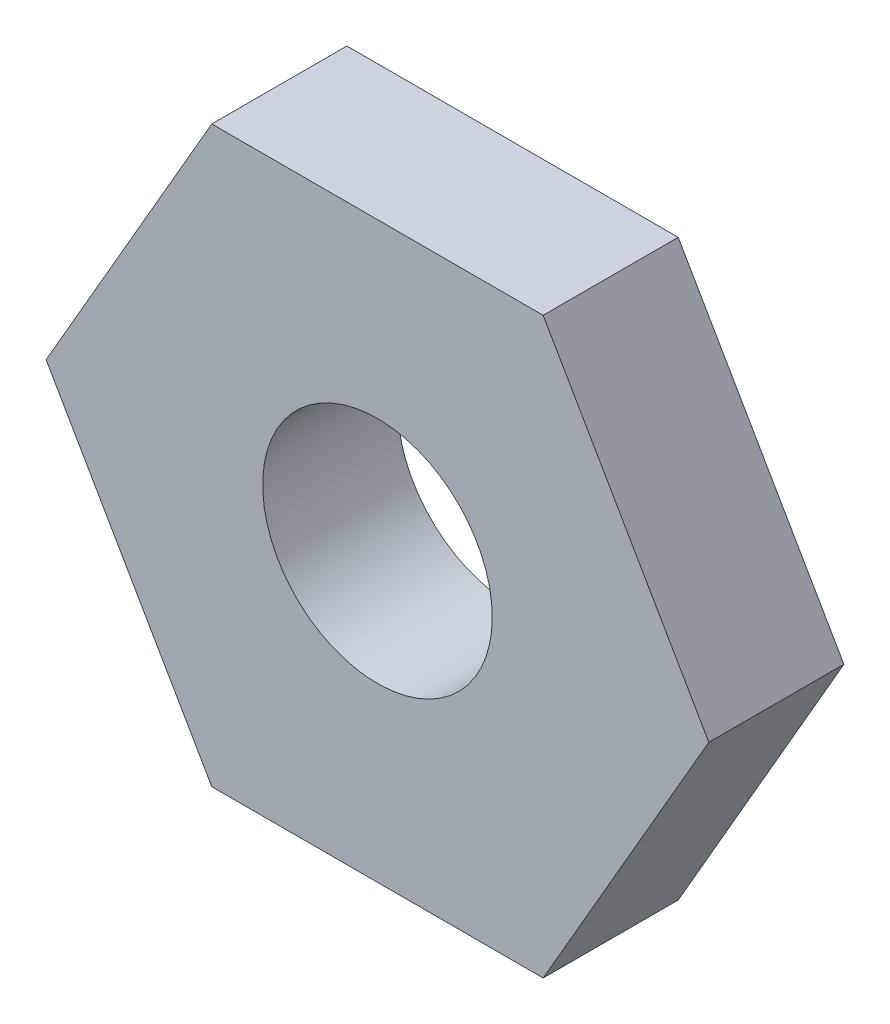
ISO-10303-21;
HEADER;
FILE_DESCRIPTION(('STEP AP214'),'2;1');
FILE_NAME('part.step','',(''),(''),'','','');
FILE_SCHEMA(('AUTOMOTIVE_DESIGN { 1 0 10303 214 1 1 1 1 }'));
ENDSEC;
DATA;
#1=APPLICATION_CONTEXT('core data for automotive mechanical design processes');
#2=APPLICATION_PROTOCOL_DEFINITION('international standard','automotive_design',2000,#1);
#3=PRODUCT_CONTEXT('',#1,'mechanical');
#4=PRODUCT('Part','Part','',(#3));
#5=PRODUCT_RELATED_PRODUCT_CATEGORY('part','',(#4));
#6=PRODUCT_DEFINITION_FORMATION('','',#4);
#7=PRODUCT_DEFINITION_CONTEXT('part definition',#1,'design');
#8=PRODUCT_DEFINITION('design','',#6,#7);
#9=PRODUCT_DEFINITION_SHAPE('','',#8);
#10=(LENGTH_UNIT() NAMED_UNIT(*) SI_UNIT(.MILLI.,.METRE.));
#11=(NAMED_UNIT(*) PLANE_ANGLE_UNIT() SI_UNIT($,.RADIAN.));
#12=(NAMED_UNIT(*) SI_UNIT($,.STERADIAN.) SOLID_ANGLE_UNIT());
#13=UNCERTAINTY_MEASURE_WITH_UNIT(LENGTH_MEASURE(1.E-05),#10,'distance_accuracy_value','');
#14=(GEOMETRIC_REPRESENTATION_CONTEXT(3) GLOBAL_UNCERTAINTY_ASSIGNED_CONTEXT((#13)) GLOBAL_UNIT_ASSIGNED_CONTEXT((#10,
#11,#12)) REPRESENTATION_CONTEXT('',''));
#15=CARTESIAN_POINT('',(0.,0.,0.));
#16=DIRECTION('',(0.,0.,1.));
#17=DIRECTION('',(1.,0.,0.));
#18=AXIS2_PLACEMENT_3D('',#15,#16,#17);
#19=CARTESIAN_POINT('',(-4.90747728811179,-8.5,4.));
#20=DIRECTION('',(0.866025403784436,0.500000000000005,0.));
#21=DIRECTION('',(-0.500000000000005,0.866025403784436,0.));
#22=AXIS2_PLACEMENT_3D('',#19,#20,#21);
#23=PLANE('',#22);
#24=DIRECTION('',(0.500000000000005,-0.866025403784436,0.));
#25=VECTOR('',#24,1.);
#26=CARTESIAN_POINT('',(-4.90747728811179,-8.5,0.));
#27=LINE('',#26,#25);
#28=CARTESIAN_POINT('',(-9.81495457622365,0.,0.));
#29=VERTEX_POINT('',#28);
#30=CARTESIAN_POINT('',(-4.90747728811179,-8.5,0.));
#31=VERTEX_POINT('',#30);
#32=EDGE_CURVE('E87',#29,#31,#27,.T.);
#33=ORIENTED_EDGE('',*,*,#32,.T.);
#34=DIRECTION('',(0.,0.,-1.));
#35=VECTOR('',#34,1.);
#36=CARTESIAN_POINT('',(-4.90747728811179,-8.5,4.));
#37=LINE('',#36,#35);
#38=CARTESIAN_POINT('',(-4.90747728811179,-8.5,4.));
#39=VERTEX_POINT('',#38);
#40=EDGE_CURVE('E11',#39,#31,#37,.T.);
#41=ORIENTED_EDGE('',*,*,#40,.F.);
#42=DIRECTION('',(0.500000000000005,-0.866025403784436,0.));
#43=VECTOR('',#42,1.);
#44=CARTESIAN_POINT('',(-4.90747728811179,-8.5,4.));
#45=LINE('',#44,#43);
#46=CARTESIAN_POINT('',(-9.81495457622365,0.,4.));
#47=VERTEX_POINT('',#46);
#48=EDGE_CURVE('E115',#47,#39,#45,.T.);
#49=ORIENTED_EDGE('',*,*,#48,.F.);
#50=DIRECTION('',(0.,0.,-1.));
#51=VECTOR('',#50,1.);
#52=CARTESIAN_POINT('',(-9.81495457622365,0.,4.));
#53=LINE('',#52,#51);
#54=EDGE_CURVE('E100',#47,#29,#53,.T.);
#55=ORIENTED_EDGE('',*,*,#54,.T.);
#56=EDGE_LOOP('',(#33,#41,#49,#55));
#57=FACE_BOUND('',#56,.T.);
#58=ADVANCED_FACE('F31',(#57),#23,.F.);
#59=CARTESIAN_POINT('',(4.90747728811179,-8.5,4.));
#60=DIRECTION('',(0.,1.,0.));
#61=DIRECTION('',(-1.,0.,0.));
#62=AXIS2_PLACEMENT_3D('',#59,#60,#61);
#63=PLANE('',#62);
#64=DIRECTION('',(1.,0.,0.));
#65=VECTOR('',#64,1.);
#66=CARTESIAN_POINT('',(4.90747728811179,-8.5,0.));
#67=LINE('',#66,#65);
#68=CARTESIAN_POINT('',(4.90747728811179,-8.5,0.));
#69=VERTEX_POINT('',#68);
#70=EDGE_CURVE('E83',#31,#69,#67,.T.);
#71=ORIENTED_EDGE('',*,*,#70,.T.);
#72=DIRECTION('',(0.,0.,-1.));
#73=VECTOR('',#72,1.);
#74=CARTESIAN_POINT('',(4.90747728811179,-8.5,4.));
#75=LINE('',#74,#73);
#76=CARTESIAN_POINT('',(4.90747728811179,-8.5,4.));
#77=VERTEX_POINT('',#76);
#78=EDGE_CURVE('E38',#77,#69,#75,.T.);
#79=ORIENTED_EDGE('',*,*,#78,.F.);
#80=DIRECTION('',(1.,0.,0.));
#81=VECTOR('',#80,1.);
#82=CARTESIAN_POINT('',(4.90747728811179,-8.5,4.));
#83=LINE('',#82,#81);
#84=EDGE_CURVE('E96',#39,#77,#83,.T.);
#85=ORIENTED_EDGE('',*,*,#84,.F.);
#86=ORIENTED_EDGE('',*,*,#40,.T.);
#87=EDGE_LOOP('',(#71,#79,#85,#86));
#88=FACE_BOUND('',#87,.T.);
#89=ADVANCED_FACE('F95',(#88),#63,.F.);
#90=CARTESIAN_POINT('',(9.81495457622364,0.,4.));
#91=DIRECTION('',(-0.866025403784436,0.500000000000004,0.));
#92=DIRECTION('',(-0.500000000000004,-0.866025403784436,0.));
#93=AXIS2_PLACEMENT_3D('',#90,#91,#92);
#94=PLANE('',#93);
#95=DIRECTION('',(0.500000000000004,0.866025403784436,0.));
#96=VECTOR('',#95,1.);
#97=CARTESIAN_POINT('',(9.81495457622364,0.,0.));
#98=LINE('',#97,#96);
#99=CARTESIAN_POINT('',(9.81495457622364,0.,0.));
#100=VERTEX_POINT('',#99);
#101=EDGE_CURVE('E89',#69,#100,#98,.T.);
#102=ORIENTED_EDGE('',*,*,#101,.T.);
#103=DIRECTION('',(0.,0.,-1.));
#104=VECTOR('',#103,1.);
#105=CARTESIAN_POINT('',(9.81495457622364,0.,4.));
#106=LINE('',#105,#104);
#107=CARTESIAN_POINT('',(9.81495457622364,0.,4.));
#108=VERTEX_POINT('',#107);
#109=EDGE_CURVE('E131',#108,#100,#106,.T.);
#110=ORIENTED_EDGE('',*,*,#109,.F.);
#111=DIRECTION('',(0.500000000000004,0.866025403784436,0.));
#112=VECTOR('',#111,1.);
#113=CARTESIAN_POINT('',(9.81495457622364,0.,4.));
#114=LINE('',#113,#112);
#115=EDGE_CURVE('E118',#77,#108,#114,.T.);
#116=ORIENTED_EDGE('',*,*,#115,.F.);
#117=ORIENTED_EDGE('',*,*,#78,.T.);
#118=EDGE_LOOP('',(#102,#110,#116,#117));
#119=FACE_BOUND('',#118,.T.);
#120=ADVANCED_FACE('F135',(#119),#94,.F.);
#121=CARTESIAN_POINT('',(4.90747728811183,8.5,4.));
#122=DIRECTION('',(-0.86602540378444,-0.499999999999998,0.));
#123=DIRECTION('',(0.499999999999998,-0.86602540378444,0.));
#124=AXIS2_PLACEMENT_3D('',#121,#122,#123);
#125=PLANE('',#124);
#126=DIRECTION('',(-0.499999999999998,0.86602540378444,0.));
#127=VECTOR('',#126,1.);
#128=CARTESIAN_POINT('',(4.90747728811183,8.5,0.));
#129=LINE('',#128,#127);
#130=CARTESIAN_POINT('',(4.90747728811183,8.5,0.));
#131=VERTEX_POINT('',#130);
#132=EDGE_CURVE('E109',#100,#131,#129,.T.);
#133=ORIENTED_EDGE('',*,*,#132,.T.);
#134=DIRECTION('',(0.,0.,-1.));
#135=VECTOR('',#134,1.);
#136=CARTESIAN_POINT('',(4.90747728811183,8.5,4.));
#137=LINE('',#136,#135);
#138=CARTESIAN_POINT('',(4.90747728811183,8.5,4.));
#139=VERTEX_POINT('',#138);
#140=EDGE_CURVE('E128',#139,#131,#137,.T.);
#141=ORIENTED_EDGE('',*,*,#140,.F.);
#142=DIRECTION('',(-0.499999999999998,0.86602540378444,0.));
#143=VECTOR('',#142,1.);
#144=CARTESIAN_POINT('',(4.90747728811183,8.5,4.));
#145=LINE('',#144,#143);
#146=EDGE_CURVE('E120',#108,#139,#145,.T.);
#147=ORIENTED_EDGE('',*,*,#146,.F.);
#148=ORIENTED_EDGE('',*,*,#109,.T.);
#149=EDGE_LOOP('',(#133,#141,#147,#148));
#150=FACE_BOUND('',#149,.T.);
#151=ADVANCED_FACE('F141',(#150),#125,.F.);
#152=CARTESIAN_POINT('',(-4.90747728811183,8.5,4.));
#153=DIRECTION('',(0.,-1.,0.));
#154=DIRECTION('',(0.,0.,-1.));
#155=AXIS2_PLACEMENT_3D('',#152,#153,#154);
#156=PLANE('',#155);
#157=DIRECTION('',(-1.,0.,0.));
#158=VECTOR('',#157,1.);
#159=CARTESIAN_POINT('',(-4.90747728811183,8.5,0.));
#160=LINE('',#159,#158);
#161=CARTESIAN_POINT('',(-4.90747728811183,8.5,0.));
#162=VERTEX_POINT('',#161);
#163=EDGE_CURVE('E111',#131,#162,#160,.T.);
#164=ORIENTED_EDGE('',*,*,#163,.T.);
#165=DIRECTION('',(0.,0.,-1.));
#166=VECTOR('',#165,1.);
#167=CARTESIAN_POINT('',(-4.90747728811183,8.5,4.));
#168=LINE('',#167,#166);
#169=CARTESIAN_POINT('',(-4.90747728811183,8.5,4.));
#170=VERTEX_POINT('',#169);
#171=EDGE_CURVE('E125',#170,#162,#168,.T.);
#172=ORIENTED_EDGE('',*,*,#171,.F.);
#173=DIRECTION('',(-1.,0.,0.));
#174=VECTOR('',#173,1.);
#175=CARTESIAN_POINT('',(-4.90747728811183,8.5,4.));
#176=LINE('',#175,#174);
#177=EDGE_CURVE('E50',#139,#170,#176,.T.);
#178=ORIENTED_EDGE('',*,*,#177,.F.);
#179=ORIENTED_EDGE('',*,*,#140,.T.);
#180=EDGE_LOOP('',(#164,#172,#178,#179));
#181=FACE_BOUND('',#180,.T.);
#182=ADVANCED_FACE('F144',(#181),#156,.F.);
#183=CARTESIAN_POINT('',(-9.81495457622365,0.,4.));
#184=DIRECTION('',(0.86602540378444,-0.499999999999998,0.));
#185=DIRECTION('',(0.499999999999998,0.86602540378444,0.));
#186=AXIS2_PLACEMENT_3D('',#183,#184,#185);
#187=PLANE('',#186);
#188=DIRECTION('',(-0.499999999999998,-0.86602540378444,0.));
#189=VECTOR('',#188,1.);
#190=CARTESIAN_POINT('',(-9.81495457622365,0.,0.));
#191=LINE('',#190,#189);
#192=EDGE_CURVE('E113',#162,#29,#191,.T.);
#193=ORIENTED_EDGE('',*,*,#192,.T.);
#194=ORIENTED_EDGE('',*,*,#54,.F.);
#195=DIRECTION('',(-0.499999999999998,-0.86602540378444,0.));
#196=VECTOR('',#195,1.);
#197=CARTESIAN_POINT('',(-9.81495457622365,0.,4.));
#198=LINE('',#197,#196);
#199=EDGE_CURVE('E45',#170,#47,#198,.T.);
#200=ORIENTED_EDGE('',*,*,#199,.F.);
#201=ORIENTED_EDGE('',*,*,#171,.T.);
#202=EDGE_LOOP('',(#193,#194,#200,#201));
#203=FACE_BOUND('',#202,.T.);
#204=ADVANCED_FACE('F146',(#203),#187,.F.);
#205=CARTESIAN_POINT('',(0.,-16.9999999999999,4.));
#206=DIRECTION('',(0.,0.,1.));
#207=DIRECTION('',(1.,0.,0.));
#208=AXIS2_PLACEMENT_3D('',#205,#206,#207);
#209=PLANE('',#208);
#210=CARTESIAN_POINT('',(0.,0.,4.));
#211=DIRECTION('',(0.,0.,1.));
#212=DIRECTION('',(1.,0.,0.));
#213=AXIS2_PLACEMENT_3D('',#210,#211,#212);
#214=CIRCLE('',#213,3.39999999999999);
#215=CARTESIAN_POINT('',(3.39999999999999,0.,4.));
#216=VERTEX_POINT('',#215);
#217=EDGE_CURVE('E104',#216,#216,#214,.T.);
#218=ORIENTED_EDGE('',*,*,#217,.F.);
#219=EDGE_LOOP('',(#218));
#220=FACE_BOUND('',#219,.T.);
#221=ORIENTED_EDGE('',*,*,#48,.T.);
#222=ORIENTED_EDGE('',*,*,#84,.T.);
#223=ORIENTED_EDGE('',*,*,#115,.T.);
#224=ORIENTED_EDGE('',*,*,#146,.T.);
#225=ORIENTED_EDGE('',*,*,#177,.T.);
#226=ORIENTED_EDGE('',*,*,#199,.T.);
#227=EDGE_LOOP('',(#221,#222,#223,#224,#225,#226));
#228=FACE_BOUND('',#227,.T.);
#229=ADVANCED_FACE('F138',(#220,#228),#209,.T.);
#230=CARTESIAN_POINT('',(0.,-16.9999999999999,0.));
#231=DIRECTION('',(0.,0.,1.));
#232=DIRECTION('',(1.,0.,0.));
#233=AXIS2_PLACEMENT_3D('',#230,#231,#232);
#234=PLANE('',#233);
#235=CARTESIAN_POINT('',(0.,0.,0.));
#236=DIRECTION('',(0.,0.,1.));
#237=DIRECTION('',(1.,0.,0.));
#238=AXIS2_PLACEMENT_3D('',#235,#236,#237);
#239=CIRCLE('',#238,3.4);
#240=CARTESIAN_POINT('',(3.4,0.,0.));
#241=VERTEX_POINT('',#240);
#242=EDGE_CURVE('E101',#241,#241,#239,.T.);
#243=ORIENTED_EDGE('',*,*,#242,.T.);
#244=EDGE_LOOP('',(#243));
#245=FACE_BOUND('',#244,.T.);
#246=ORIENTED_EDGE('',*,*,#32,.F.);
#247=ORIENTED_EDGE('',*,*,#192,.F.);
#248=ORIENTED_EDGE('',*,*,#163,.F.);
#249=ORIENTED_EDGE('',*,*,#132,.F.);
#250=ORIENTED_EDGE('',*,*,#101,.F.);
#251=ORIENTED_EDGE('',*,*,#70,.F.);
#252=EDGE_LOOP('',(#246,#247,#248,#249,#250,#251));
#253=FACE_BOUND('',#252,.T.);
#254=ADVANCED_FACE('F84',(#245,#253),#234,.F.);
#255=CARTESIAN_POINT('',(0.,0.,4.));
#256=DIRECTION('',(0.,0.,1.));
#257=DIRECTION('',(1.,0.,0.));
#258=AXIS2_PLACEMENT_3D('',#255,#256,#257);
#259=CYLINDRICAL_SURFACE('',#258,3.39999999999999);
#260=ORIENTED_EDGE('',*,*,#242,.F.);
#261=EDGE_LOOP('',(#260));
#262=FACE_BOUND('',#261,.T.);
#263=ORIENTED_EDGE('',*,*,#217,.T.);
#264=EDGE_LOOP('',(#263));
#265=FACE_BOUND('',#264,.T.);
#266=ADVANCED_FACE('F193',(#262,#265),#259,.F.);
#267=CLOSED_SHELL('',(#58,#89,#120,#151,#182,#204,#229,#254,#266));
#268=MANIFOLD_SOLID_BREP('B2',#267);
#269=ADVANCED_BREP_SHAPE_REPRESENTATION('',(#18,#268),#14);
#270=SHAPE_DEFINITION_REPRESENTATION(#9,#269);
ENDSEC;
END-ISO-10303-21;
